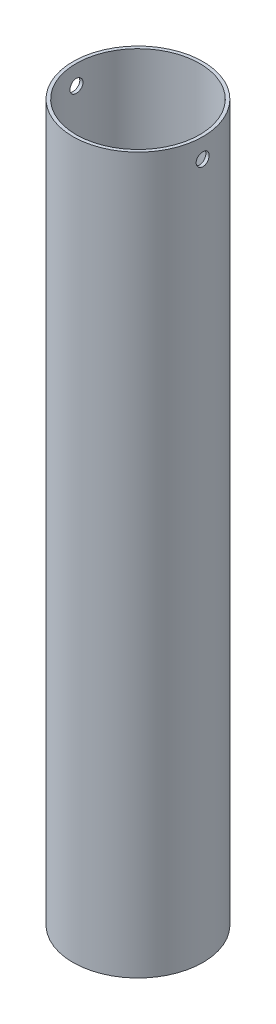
ISO-10303-21;
HEADER;
FILE_DESCRIPTION(('STEP AP214'),'2;1');
FILE_NAME('part.step','',(''),(''),'','','');
FILE_SCHEMA(('AUTOMOTIVE_DESIGN { 1 0 10303 214 1 1 1 1 }'));
ENDSEC;
DATA;
#1=APPLICATION_CONTEXT('core data for automotive mechanical design processes');
#2=APPLICATION_PROTOCOL_DEFINITION('international standard','automotive_design',2000,#1);
#3=PRODUCT_CONTEXT('',#1,'mechanical');
#4=PRODUCT('Part','Part','',(#3));
#5=PRODUCT_RELATED_PRODUCT_CATEGORY('part','',(#4));
#6=PRODUCT_DEFINITION_FORMATION('','',#4);
#7=PRODUCT_DEFINITION_CONTEXT('part definition',#1,'design');
#8=PRODUCT_DEFINITION('design','',#6,#7);
#9=PRODUCT_DEFINITION_SHAPE('','',#8);
#10=(LENGTH_UNIT() NAMED_UNIT(*) SI_UNIT(.MILLI.,.METRE.));
#11=(NAMED_UNIT(*) PLANE_ANGLE_UNIT() SI_UNIT($,.RADIAN.));
#12=(NAMED_UNIT(*) SI_UNIT($,.STERADIAN.) SOLID_ANGLE_UNIT());
#13=UNCERTAINTY_MEASURE_WITH_UNIT(LENGTH_MEASURE(1.E-05),#10,'distance_accuracy_value','');
#14=(GEOMETRIC_REPRESENTATION_CONTEXT(3) GLOBAL_UNCERTAINTY_ASSIGNED_CONTEXT((#13)) GLOBAL_UNIT_ASSIGNED_CONTEXT((#10,
#11,#12)) REPRESENTATION_CONTEXT('',''));
#15=CARTESIAN_POINT('',(0.,0.,0.));
#16=DIRECTION('',(0.,0.,1.));
#17=DIRECTION('',(1.,0.,0.));
#18=AXIS2_PLACEMENT_3D('',#15,#16,#17);
#19=CARTESIAN_POINT('',(0.,-110.,0.));
#20=DIRECTION('',(0.,1.,0.));
#21=DIRECTION('',(0.,0.,1.));
#22=AXIS2_PLACEMENT_3D('',#19,#20,#21);
#23=CYLINDRICAL_SURFACE('',#22,10.);
#24=CARTESIAN_POINT('',(-9.9498743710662,-3.,-1.));
#25=CARTESIAN_POINT('',(-9.94987502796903,-3.0560195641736,-0.999997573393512));
#26=CARTESIAN_POINT('',(-9.95035256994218,-3.11207616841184,-0.995276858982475));
#27=CARTESIAN_POINT('',(-9.95221087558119,-3.22263518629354,-0.976516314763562));
#28=CARTESIAN_POINT('',(-9.95359263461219,-3.27713581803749,-0.962466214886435));
#29=CARTESIAN_POINT('',(-9.95710133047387,-3.38296581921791,-0.925460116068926));
#30=CARTESIAN_POINT('',(-9.9592278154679,-3.43429708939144,-0.902509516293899));
#31=CARTESIAN_POINT('',(-9.9639858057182,-3.53236779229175,-0.848364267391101));
#32=CARTESIAN_POINT('',(-9.96661721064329,-3.57910813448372,-0.817171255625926));
#33=CARTESIAN_POINT('',(-9.97209926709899,-3.6668512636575,-0.747304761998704));
#34=CARTESIAN_POINT('',(-9.97495060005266,-3.70783500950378,-0.708607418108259));
#35=CARTESIAN_POINT('',(-9.98054505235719,-3.78273760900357,-0.624881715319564));
#36=CARTESIAN_POINT('',(-9.98328816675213,-3.81665613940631,-0.579853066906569));
#37=CARTESIAN_POINT('',(-9.98836383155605,-3.87653125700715,-0.484626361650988));
#38=CARTESIAN_POINT('',(-9.99069550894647,-3.90247099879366,-0.434417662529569));
#39=CARTESIAN_POINT('',(-9.9946781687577,-3.94554443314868,-0.33032998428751));
#40=CARTESIAN_POINT('',(-9.99632916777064,-3.96267834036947,-0.276451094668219));
#41=CARTESIAN_POINT('',(-9.99875966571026,-3.98759790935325,-0.16674478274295));
#42=CARTESIAN_POINT('',(-9.99954207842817,-3.99541483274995,-0.110924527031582));
#43=CARTESIAN_POINT('',(-10.0001571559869,-4.00157526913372,0.00124074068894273));
#44=CARTESIAN_POINT('',(-9.99998984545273,-3.99991902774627,0.057585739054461));
#45=CARTESIAN_POINT('',(-9.99872671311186,-3.98720552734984,0.16898884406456));
#46=CARTESIAN_POINT('',(-9.99763421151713,-3.97618188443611,0.224050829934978));
#47=CARTESIAN_POINT('',(-9.9946472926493,-3.94509887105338,0.331539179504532));
#48=CARTESIAN_POINT('',(-9.99275286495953,-3.92503938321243,0.383965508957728));
#49=CARTESIAN_POINT('',(-9.98836937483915,-3.87641723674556,0.484800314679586));
#50=CARTESIAN_POINT('',(-9.98587927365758,-3.84783970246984,0.533201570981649));
#51=CARTESIAN_POINT('',(-9.98058384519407,-3.78300347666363,0.624533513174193));
#52=CARTESIAN_POINT('',(-9.97777850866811,-3.74674455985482,0.667464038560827));
#53=CARTESIAN_POINT('',(-9.97215293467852,-3.66738577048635,0.746832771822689));
#54=CARTESIAN_POINT('',(-9.96933268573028,-3.62425665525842,0.783241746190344));
#55=CARTESIAN_POINT('',(-9.96400739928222,-3.53248313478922,0.848307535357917));
#56=CARTESIAN_POINT('',(-9.96150236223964,-3.48383872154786,0.876964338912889));
#57=CARTESIAN_POINT('',(-9.95709089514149,-3.38239297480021,0.92571218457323));
#58=CARTESIAN_POINT('',(-9.95518459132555,-3.32959076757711,0.945801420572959));
#59=CARTESIAN_POINT('',(-9.95218901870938,-3.22133939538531,0.976820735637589));
#60=CARTESIAN_POINT('',(-9.95109972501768,-3.16589031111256,0.987751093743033));
#61=CARTESIAN_POINT('',(-9.94986580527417,-3.05417582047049,1.00010477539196));
#62=CARTESIAN_POINT('',(-9.94971711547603,-2.99791497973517,1.00156899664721));
#63=CARTESIAN_POINT('',(-9.95037051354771,-2.88594873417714,0.995056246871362));
#64=CARTESIAN_POINT('',(-9.95117258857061,-2.83024332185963,0.987079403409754));
#65=CARTESIAN_POINT('',(-9.95363344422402,-2.72108841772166,0.961945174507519));
#66=CARTESIAN_POINT('',(-9.95529042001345,-2.66763442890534,0.944807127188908));
#67=CARTESIAN_POINT('',(-9.95927291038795,-2.5643599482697,0.90185671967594));
#68=CARTESIAN_POINT('',(-9.9615984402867,-2.51453953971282,0.876044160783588));
#69=CARTESIAN_POINT('',(-9.96666584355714,-2.41976002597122,0.816375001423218));
#70=CARTESIAN_POINT('',(-9.96940910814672,-2.37481805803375,0.782491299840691));
#71=CARTESIAN_POINT('',(-9.97499832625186,-2.29124494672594,0.707680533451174));
#72=CARTESIAN_POINT('',(-9.97784428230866,-2.25261395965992,0.666753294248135));
#73=CARTESIAN_POINT('',(-9.98333047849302,-2.18261836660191,0.578839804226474));
#74=CARTESIAN_POINT('',(-9.98596994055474,-2.15128044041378,0.531832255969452));
#75=CARTESIAN_POINT('',(-9.99073442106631,-2.09694413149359,0.433197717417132));
#76=CARTESIAN_POINT('',(-9.99285944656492,-2.0739456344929,0.381570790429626));
#77=CARTESIAN_POINT('',(-9.99635210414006,-2.03698623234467,0.275256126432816));
#78=CARTESIAN_POINT('',(-9.99772108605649,-2.02300921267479,0.22057403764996));
#79=CARTESIAN_POINT('',(-9.99955294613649,-2.00443693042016,0.10962481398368));
#80=CARTESIAN_POINT('',(-10.0000158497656,-1.99984140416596,0.0533577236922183));
#81=CARTESIAN_POINT('',(-9.99998338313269,-2.00016626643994,-0.0589022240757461));
#82=CARTESIAN_POINT('',(-9.99949218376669,-2.00504523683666,-0.114895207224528));
#83=CARTESIAN_POINT('',(-9.99761493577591,-2.02409374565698,-0.225261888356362));
#84=CARTESIAN_POINT('',(-9.99622888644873,-2.03826329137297,-0.279635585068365));
#85=CARTESIAN_POINT('',(-9.99271723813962,-2.07547925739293,-0.385219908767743));
#86=CARTESIAN_POINT('',(-9.99059174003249,-2.09852446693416,-0.436430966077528));
#87=CARTESIAN_POINT('',(-9.98583812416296,-2.15283316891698,-0.534264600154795));
#88=CARTESIAN_POINT('',(-9.98321000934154,-2.18409661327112,-0.580887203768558));
#89=CARTESIAN_POINT('',(-9.97773184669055,-2.25410961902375,-0.668432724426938));
#90=CARTESIAN_POINT('',(-9.97488091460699,-2.2928900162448,-0.70933092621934));
#91=CARTESIAN_POINT('',(-9.96928590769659,-2.37677535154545,-0.784057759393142));
#92=CARTESIAN_POINT('',(-9.96654185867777,-2.42188180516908,-0.817884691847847));
#93=CARTESIAN_POINT('',(-9.96146383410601,-2.51726434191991,-0.877576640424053));
#94=CARTESIAN_POINT('',(-9.95913091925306,-2.56755328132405,-0.903421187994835));
#95=CARTESIAN_POINT('',(-9.95515194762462,-2.67174829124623,-0.946264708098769));
#96=CARTESIAN_POINT('',(-9.95350511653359,-2.72565020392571,-0.963273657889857));
#97=CARTESIAN_POINT('',(-9.95150007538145,-2.81654774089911,-0.983721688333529));
#98=CARTESIAN_POINT('',(-9.95089331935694,-2.85296225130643,-0.989817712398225));
#99=CARTESIAN_POINT('',(-9.95008025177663,-2.92624582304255,-0.997957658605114));
#100=CARTESIAN_POINT('',(-9.94987393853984,-2.96311488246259,-1.00000159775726));
#101=CARTESIAN_POINT('',(-9.9498743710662,-3.,-1.));
#102=B_SPLINE_CURVE_WITH_KNOTS('',3,(#24,#25,#26,#27,#28,#29,#30,#31,#32,#33,#34,#35,#36,#37,
#38,#39,#40,#41,#42,#43,#44,#45,#46,#47,#48,#49,#50,#51,#52,#53,#54,#55,#56,#57,#58,#59,#60,#61,
#62,#63,#64,#65,#66,#67,#68,#69,#70,#71,#72,#73,#74,#75,#76,#77,#78,#79,#80,#81,#82,#83,#84,#85,
#86,#87,#88,#89,#90,#91,#92,#93,#94,#95,#96,#97,#98,#99,#100,#101),.UNSPECIFIED.,.T.,.F.,(4,2,2,
2,2,2,2,2,2,2,2,2,2,2,2,2,2,2,2,2,2,2,2,2,2,2,2,2,2,2,2,2,2,2,2,2,2,2,4),(0.,0.167923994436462,
0.336033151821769,0.504040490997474,0.672014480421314,0.840531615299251,1.00905645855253,
1.17793469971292,1.34680882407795,1.51511470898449,1.68341622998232,1.85111631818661,
2.01881858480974,2.18681545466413,2.35481725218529,2.52355425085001,2.69229149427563,
2.86106429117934,3.02983194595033,3.19786996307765,3.3659057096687,3.53358814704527,
3.70127442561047,3.86953189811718,4.03779353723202,4.20666136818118,4.37552688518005,
4.54408992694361,4.71264823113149,4.88047133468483,5.04829456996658,5.21609491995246,
5.38389428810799,5.55239715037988,5.72094045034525,5.88991241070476,6.05869314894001,
6.16926027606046,6.27982693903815),.UNSPECIFIED.);
#103=CARTESIAN_POINT('',(-9.9498743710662,-3.,-1.));
#104=VERTEX_POINT('',#103);
#105=EDGE_CURVE('E72',#104,#104,#102,.T.);
#106=ORIENTED_EDGE('',*,*,#105,.F.);
#107=EDGE_LOOP('',(#106));
#108=FACE_BOUND('',#107,.T.);
#109=CARTESIAN_POINT('',(9.9498743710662,-3.,-1.));
#110=CARTESIAN_POINT('',(9.94987502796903,-2.9439804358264,-0.999997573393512));
#111=CARTESIAN_POINT('',(9.95035256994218,-2.88792383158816,-0.995276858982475));
#112=CARTESIAN_POINT('',(9.95221087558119,-2.77736481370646,-0.976516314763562));
#113=CARTESIAN_POINT('',(9.95359263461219,-2.72286418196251,-0.962466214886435));
#114=CARTESIAN_POINT('',(9.95710133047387,-2.61703418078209,-0.925460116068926));
#115=CARTESIAN_POINT('',(9.9592278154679,-2.56570291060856,-0.902509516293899));
#116=CARTESIAN_POINT('',(9.9639858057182,-2.46763220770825,-0.848364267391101));
#117=CARTESIAN_POINT('',(9.96661721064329,-2.42089186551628,-0.817171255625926));
#118=CARTESIAN_POINT('',(9.97209926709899,-2.3331487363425,-0.747304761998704));
#119=CARTESIAN_POINT('',(9.97495060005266,-2.29216499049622,-0.708607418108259));
#120=CARTESIAN_POINT('',(9.98054505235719,-2.21726239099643,-0.624881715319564));
#121=CARTESIAN_POINT('',(9.98328816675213,-2.18334386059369,-0.579853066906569));
#122=CARTESIAN_POINT('',(9.98836383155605,-2.12346874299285,-0.484626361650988));
#123=CARTESIAN_POINT('',(9.99069550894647,-2.09752900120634,-0.434417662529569));
#124=CARTESIAN_POINT('',(9.9946781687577,-2.05445556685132,-0.330329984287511));
#125=CARTESIAN_POINT('',(9.99632916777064,-2.03732165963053,-0.276451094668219));
#126=CARTESIAN_POINT('',(9.99875966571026,-2.01240209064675,-0.16674478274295));
#127=CARTESIAN_POINT('',(9.99954207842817,-2.00458516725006,-0.110924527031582));
#128=CARTESIAN_POINT('',(10.0001571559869,-1.99842473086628,0.00124074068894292));
#129=CARTESIAN_POINT('',(9.99998984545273,-2.00008097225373,0.0575857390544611));
#130=CARTESIAN_POINT('',(9.99872671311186,-2.01279447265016,0.16898884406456));
#131=CARTESIAN_POINT('',(9.99763421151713,-2.02381811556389,0.224050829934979));
#132=CARTESIAN_POINT('',(9.9946472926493,-2.05490112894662,0.331539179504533));
#133=CARTESIAN_POINT('',(9.99275286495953,-2.07496061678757,0.383965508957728));
#134=CARTESIAN_POINT('',(9.98836937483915,-2.12358276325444,0.484800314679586));
#135=CARTESIAN_POINT('',(9.98587927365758,-2.15216029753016,0.533201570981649));
#136=CARTESIAN_POINT('',(9.98058384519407,-2.21699652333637,0.624533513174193));
#137=CARTESIAN_POINT('',(9.97777850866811,-2.25325544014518,0.667464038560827));
#138=CARTESIAN_POINT('',(9.97215293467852,-2.33261422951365,0.746832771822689));
#139=CARTESIAN_POINT('',(9.96933268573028,-2.37574334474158,0.783241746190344));
#140=CARTESIAN_POINT('',(9.96400739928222,-2.46751686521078,0.848307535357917));
#141=CARTESIAN_POINT('',(9.96150236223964,-2.51616127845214,0.876964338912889));
#142=CARTESIAN_POINT('',(9.95709089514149,-2.61760702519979,0.92571218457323));
#143=CARTESIAN_POINT('',(9.95518459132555,-2.67040923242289,0.94580142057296));
#144=CARTESIAN_POINT('',(9.95218901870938,-2.77866060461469,0.976820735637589));
#145=CARTESIAN_POINT('',(9.95109972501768,-2.83410968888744,0.987751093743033));
#146=CARTESIAN_POINT('',(9.94986580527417,-2.94582417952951,1.00010477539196));
#147=CARTESIAN_POINT('',(9.94971711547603,-3.00208502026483,1.00156899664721));
#148=CARTESIAN_POINT('',(9.95037051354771,-3.11405126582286,0.995056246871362));
#149=CARTESIAN_POINT('',(9.95117258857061,-3.16975667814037,0.987079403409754));
#150=CARTESIAN_POINT('',(9.95363344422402,-3.27891158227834,0.961945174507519));
#151=CARTESIAN_POINT('',(9.95529042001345,-3.33236557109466,0.944807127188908));
#152=CARTESIAN_POINT('',(9.95927291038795,-3.4356400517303,0.90185671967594));
#153=CARTESIAN_POINT('',(9.9615984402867,-3.48546046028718,0.876044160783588));
#154=CARTESIAN_POINT('',(9.96666584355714,-3.58023997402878,0.816375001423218));
#155=CARTESIAN_POINT('',(9.96940910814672,-3.62518194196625,0.782491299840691));
#156=CARTESIAN_POINT('',(9.97499832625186,-3.70875505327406,0.707680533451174));
#157=CARTESIAN_POINT('',(9.97784428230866,-3.74738604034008,0.666753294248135));
#158=CARTESIAN_POINT('',(9.98333047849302,-3.81738163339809,0.578839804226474));
#159=CARTESIAN_POINT('',(9.98596994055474,-3.84871955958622,0.531832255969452));
#160=CARTESIAN_POINT('',(9.99073442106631,-3.90305586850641,0.433197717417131));
#161=CARTESIAN_POINT('',(9.99285944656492,-3.9260543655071,0.381570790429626));
#162=CARTESIAN_POINT('',(9.99635210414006,-3.96301376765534,0.275256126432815));
#163=CARTESIAN_POINT('',(9.99772108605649,-3.97699078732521,0.22057403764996));
#164=CARTESIAN_POINT('',(9.99955294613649,-3.99556306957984,0.10962481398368));
#165=CARTESIAN_POINT('',(10.0000158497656,-4.00015859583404,0.053357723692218));
#166=CARTESIAN_POINT('',(9.99998338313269,-3.99983373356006,-0.0589022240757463));
#167=CARTESIAN_POINT('',(9.99949218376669,-3.99495476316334,-0.114895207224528));
#168=CARTESIAN_POINT('',(9.99761493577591,-3.97590625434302,-0.225261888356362));
#169=CARTESIAN_POINT('',(9.99622888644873,-3.96173670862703,-0.279635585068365));
#170=CARTESIAN_POINT('',(9.99271723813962,-3.92452074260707,-0.385219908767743));
#171=CARTESIAN_POINT('',(9.99059174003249,-3.90147553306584,-0.436430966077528));
#172=CARTESIAN_POINT('',(9.98583812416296,-3.84716683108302,-0.534264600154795));
#173=CARTESIAN_POINT('',(9.98321000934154,-3.81590338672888,-0.580887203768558));
#174=CARTESIAN_POINT('',(9.97773184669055,-3.74589038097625,-0.668432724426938));
#175=CARTESIAN_POINT('',(9.97488091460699,-3.7071099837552,-0.70933092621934));
#176=CARTESIAN_POINT('',(9.96928590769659,-3.62322464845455,-0.784057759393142));
#177=CARTESIAN_POINT('',(9.96654185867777,-3.57811819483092,-0.817884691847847));
#178=CARTESIAN_POINT('',(9.96146383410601,-3.48273565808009,-0.877576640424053));
#179=CARTESIAN_POINT('',(9.95913091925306,-3.43244671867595,-0.903421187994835));
#180=CARTESIAN_POINT('',(9.95515194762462,-3.32825170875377,-0.946264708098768));
#181=CARTESIAN_POINT('',(9.95350511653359,-3.27434979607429,-0.963273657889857));
#182=CARTESIAN_POINT('',(9.95150007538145,-3.18345225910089,-0.983721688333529));
#183=CARTESIAN_POINT('',(9.95089331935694,-3.14703774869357,-0.989817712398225));
#184=CARTESIAN_POINT('',(9.95008025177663,-3.07375417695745,-0.997957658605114));
#185=CARTESIAN_POINT('',(9.94987393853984,-3.03688511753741,-1.00000159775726));
#186=CARTESIAN_POINT('',(9.9498743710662,-3.,-1.));
#187=B_SPLINE_CURVE_WITH_KNOTS('',3,(#109,#110,#111,#112,#113,#114,#115,#116,#117,#118,#119,
#120,#121,#122,#123,#124,#125,#126,#127,#128,#129,#130,#131,#132,#133,#134,#135,#136,#137,#138,
#139,#140,#141,#142,#143,#144,#145,#146,#147,#148,#149,#150,#151,#152,#153,#154,#155,#156,#157,
#158,#159,#160,#161,#162,#163,#164,#165,#166,#167,#168,#169,#170,#171,#172,#173,#174,#175,#176,
#177,#178,#179,#180,#181,#182,#183,#184,#185,#186),.UNSPECIFIED.,.T.,.F.,(4,2,2,2,2,2,2,2,2,2,2,
2,2,2,2,2,2,2,2,2,2,2,2,2,2,2,2,2,2,2,2,2,2,2,2,2,2,2,4),(0.,0.167923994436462,
0.336033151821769,0.504040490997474,0.672014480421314,0.84053161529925,1.00905645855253,
1.17793469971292,1.34680882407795,1.51511470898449,1.68341622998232,1.85111631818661,
2.01881858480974,2.18681545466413,2.35481725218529,2.52355425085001,2.69229149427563,
2.86106429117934,3.02983194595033,3.19786996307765,3.3659057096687,3.53358814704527,
3.70127442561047,3.86953189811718,4.03779353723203,4.20666136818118,4.37552688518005,
4.54408992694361,4.71264823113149,4.88047133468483,5.04829456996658,5.21609491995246,
5.38389428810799,5.55239715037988,5.72094045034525,5.88991241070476,6.05869314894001,
6.16926027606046,6.27982693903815),.UNSPECIFIED.);
#188=CARTESIAN_POINT('',(9.9498743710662,-3.,-1.));
#189=VERTEX_POINT('',#188);
#190=EDGE_CURVE('E68',#189,#189,#187,.T.);
#191=ORIENTED_EDGE('',*,*,#190,.F.);
#192=EDGE_LOOP('',(#191));
#193=FACE_BOUND('',#192,.T.);
#194=CARTESIAN_POINT('',(0.,-110.,0.));
#195=DIRECTION('',(0.,1.,0.));
#196=DIRECTION('',(0.,0.,1.));
#197=AXIS2_PLACEMENT_3D('',#194,#195,#196);
#198=CIRCLE('',#197,10.);
#199=CARTESIAN_POINT('',(0.,-110.,10.));
#200=VERTEX_POINT('',#199);
#201=EDGE_CURVE('E10',#200,#200,#198,.T.);
#202=ORIENTED_EDGE('',*,*,#201,.T.);
#203=EDGE_LOOP('',(#202));
#204=FACE_BOUND('',#203,.T.);
#205=CARTESIAN_POINT('',(0.,0.,0.));
#206=DIRECTION('',(0.,1.,0.));
#207=DIRECTION('',(0.,0.,1.));
#208=AXIS2_PLACEMENT_3D('',#205,#206,#207);
#209=CIRCLE('',#208,10.);
#210=CARTESIAN_POINT('',(0.,0.,10.));
#211=VERTEX_POINT('',#210);
#212=EDGE_CURVE('E41',#211,#211,#209,.T.);
#213=ORIENTED_EDGE('',*,*,#212,.F.);
#214=EDGE_LOOP('',(#213));
#215=FACE_BOUND('',#214,.T.);
#216=ADVANCED_FACE('F29',(#108,#193,#204,#215),#23,.T.);
#217=CARTESIAN_POINT('',(0.,-110.,0.));
#218=DIRECTION('',(0.,1.,0.));
#219=DIRECTION('',(0.,0.,1.));
#220=AXIS2_PLACEMENT_3D('',#217,#218,#219);
#221=PLANE('',#220);
#222=CARTESIAN_POINT('',(0.,-110.,0.));
#223=DIRECTION('',(0.,1.,0.));
#224=DIRECTION('',(0.,0.,1.));
#225=AXIS2_PLACEMENT_3D('',#222,#223,#224);
#226=CIRCLE('',#225,9.5);
#227=CARTESIAN_POINT('',(0.,-110.,9.5));
#228=VERTEX_POINT('',#227);
#229=EDGE_CURVE('E46',#228,#228,#226,.T.);
#230=ORIENTED_EDGE('',*,*,#229,.T.);
#231=EDGE_LOOP('',(#230));
#232=FACE_BOUND('',#231,.T.);
#233=ORIENTED_EDGE('',*,*,#201,.F.);
#234=EDGE_LOOP('',(#233));
#235=FACE_BOUND('',#234,.T.);
#236=ADVANCED_FACE('F86',(#232,#235),#221,.F.);
#237=CARTESIAN_POINT('',(0.,0.,0.));
#238=DIRECTION('',(0.,1.,0.));
#239=DIRECTION('',(0.,0.,1.));
#240=AXIS2_PLACEMENT_3D('',#237,#238,#239);
#241=PLANE('',#240);
#242=CARTESIAN_POINT('',(0.,0.,0.));
#243=DIRECTION('',(0.,1.,0.));
#244=DIRECTION('',(0.,0.,1.));
#245=AXIS2_PLACEMENT_3D('',#242,#243,#244);
#246=CIRCLE('',#245,9.5);
#247=CARTESIAN_POINT('',(0.,0.,9.5));
#248=VERTEX_POINT('',#247);
#249=EDGE_CURVE('E49',#248,#248,#246,.T.);
#250=ORIENTED_EDGE('',*,*,#249,.F.);
#251=EDGE_LOOP('',(#250));
#252=FACE_BOUND('',#251,.T.);
#253=ORIENTED_EDGE('',*,*,#212,.T.);
#254=EDGE_LOOP('',(#253));
#255=FACE_BOUND('',#254,.T.);
#256=ADVANCED_FACE('F83',(#252,#255),#241,.T.);
#257=CARTESIAN_POINT('',(0.,-110.,0.));
#258=DIRECTION('',(0.,1.,0.));
#259=DIRECTION('',(0.,0.,1.));
#260=AXIS2_PLACEMENT_3D('',#257,#258,#259);
#261=CYLINDRICAL_SURFACE('',#260,9.5);
#262=CARTESIAN_POINT('',(-9.44722181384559,-3.,-1.));
#263=CARTESIAN_POINT('',(-9.44722250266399,-3.05600323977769,-0.99999758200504));
#264=CARTESIAN_POINT('',(-9.44772516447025,-3.1120431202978,-0.995279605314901));
#265=CARTESIAN_POINT('',(-9.44968112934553,-3.22256802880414,-0.97653057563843));
#266=CARTESIAN_POINT('',(-9.45113546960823,-3.27705129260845,-0.962489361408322));
#267=CARTESIAN_POINT('',(-9.45482827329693,-3.38284646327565,-0.925508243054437));
#268=CARTESIAN_POINT('',(-9.45706625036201,-3.43416031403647,-0.902573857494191));
#269=CARTESIAN_POINT('',(-9.46207356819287,-3.53219959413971,-0.848468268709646));
#270=CARTESIAN_POINT('',(-9.46484280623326,-3.57892590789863,-0.817298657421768));
#271=CARTESIAN_POINT('',(-9.47061306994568,-3.66666202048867,-0.74747313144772));
#272=CARTESIAN_POINT('',(-9.47361488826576,-3.70765080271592,-0.708790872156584));
#273=CARTESIAN_POINT('',(-9.47950490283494,-3.78256723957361,-0.62509450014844));
#274=CARTESIAN_POINT('',(-9.4823930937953,-3.81649456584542,-0.580080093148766));
#275=CARTESIAN_POINT('',(-9.48773832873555,-3.87639828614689,-0.484867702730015));
#276=CARTESIAN_POINT('',(-9.49019435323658,-3.90235598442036,-0.434657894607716));
#277=CARTESIAN_POINT('',(-9.49438988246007,-3.94546397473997,-0.330561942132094));
#278=CARTESIAN_POINT('',(-9.49612940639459,-3.96261450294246,-0.276675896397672));
#279=CARTESIAN_POINT('',(-9.49869036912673,-3.98755941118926,-0.166970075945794));
#280=CARTESIAN_POINT('',(-9.4995152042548,-3.99538841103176,-0.111158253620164));
#281=CARTESIAN_POINT('',(-9.50016541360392,-4.00157517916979,0.0009928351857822));
#282=CARTESIAN_POINT('',(-9.49999081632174,-3.99993321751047,0.057332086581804));
#283=CARTESIAN_POINT('',(-9.49866460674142,-3.98725270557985,0.168703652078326));
#284=CARTESIAN_POINT('',(-9.4975168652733,-3.97625138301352,0.223740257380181));
#285=CARTESIAN_POINT('',(-9.49437776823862,-3.94522247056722,0.331181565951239));
#286=CARTESIAN_POINT('',(-9.49238640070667,-3.92519475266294,0.383586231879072));
#287=CARTESIAN_POINT('',(-9.48777724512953,-3.87664098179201,0.484393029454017));
#288=CARTESIAN_POINT('',(-9.4851582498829,-3.84809852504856,0.532787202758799));
#289=CARTESIAN_POINT('',(-9.47958754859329,-3.78333740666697,0.624112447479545));
#290=CARTESIAN_POINT('',(-9.47663583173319,-3.74711849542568,0.667043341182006));
#291=CARTESIAN_POINT('',(-9.47071386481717,-3.66782338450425,0.746441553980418));
#292=CARTESIAN_POINT('',(-9.46774359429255,-3.62471478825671,0.782876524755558));
#293=CARTESIAN_POINT('',(-9.46213353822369,-3.532976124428,0.847998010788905));
#294=CARTESIAN_POINT('',(-9.45949375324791,-3.48434604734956,0.876684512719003));
#295=CARTESIAN_POINT('',(-9.45484337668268,-3.38291923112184,0.925494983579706));
#296=CARTESIAN_POINT('',(-9.45283294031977,-3.33012146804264,0.945616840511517));
#297=CARTESIAN_POINT('',(-9.44967206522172,-3.22187081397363,0.976700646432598));
#298=CARTESIAN_POINT('',(-9.44852159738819,-3.16641801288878,0.987662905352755));
#299=CARTESIAN_POINT('',(-9.44721601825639,-3.05471569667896,1.00007449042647));
#300=CARTESIAN_POINT('',(-9.44705616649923,-2.9984712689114,1.00156912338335));
#301=CARTESIAN_POINT('',(-9.44773740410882,-2.88653277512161,0.995122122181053));
#302=CARTESIAN_POINT('',(-9.44857847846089,-2.83083870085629,0.987180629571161));
#303=CARTESIAN_POINT('',(-9.45116248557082,-2.72171463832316,0.962124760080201));
#304=CARTESIAN_POINT('',(-9.45290330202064,-2.66827965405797,0.945031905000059));
#305=CARTESIAN_POINT('',(-9.457088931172,-2.56503510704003,0.902180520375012));
#306=CARTESIAN_POINT('',(-9.45953376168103,-2.51522563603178,0.876421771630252));
#307=CARTESIAN_POINT('',(-9.46486340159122,-2.42043980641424,0.816856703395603));
#308=CARTESIAN_POINT('',(-9.46774983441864,-2.3754823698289,0.78302042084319));
#309=CARTESIAN_POINT('',(-9.47363218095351,-2.29186889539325,0.708303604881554));
#310=CARTESIAN_POINT('',(-9.47662809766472,-2.25321303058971,0.667422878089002));
#311=CARTESIAN_POINT('',(-9.48240620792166,-2.18314319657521,0.579580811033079));
#312=CARTESIAN_POINT('',(-9.48518749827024,-2.15175882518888,0.532595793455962));
#313=CARTESIAN_POINT('',(-9.49020976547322,-2.09732675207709,0.433995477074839));
#314=CARTESIAN_POINT('',(-9.49245075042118,-2.07427892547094,0.382380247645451));
#315=CARTESIAN_POINT('',(-9.49613584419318,-2.03722409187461,0.27608703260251));
#316=CARTESIAN_POINT('',(-9.49758151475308,-2.02319935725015,0.221415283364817));
#317=CARTESIAN_POINT('',(-9.49951951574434,-2.00453099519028,0.110476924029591));
#318=CARTESIAN_POINT('',(-9.50001187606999,-1.99988707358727,0.0542103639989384));
#319=CARTESIAN_POINT('',(-9.49998774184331,-2.0001165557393,-0.0580300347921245));
#320=CARTESIAN_POINT('',(-9.49947611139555,-2.00494407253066,-0.114003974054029));
#321=CARTESIAN_POINT('',(-9.49751109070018,-2.02388298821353,-0.224340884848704));
#322=CARTESIAN_POINT('',(-9.49605769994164,-2.03799439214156,-0.278703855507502));
#323=CARTESIAN_POINT('',(-9.49237193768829,-2.07508745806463,-0.38427419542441));
#324=CARTESIAN_POINT('',(-9.490139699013,-2.09806760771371,-0.43548210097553));
#325=CARTESIAN_POINT('',(-9.48514475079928,-2.15224100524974,-0.533321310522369));
#326=CARTESIAN_POINT('',(-9.48238204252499,-2.18343423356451,-0.579952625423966));
#327=CARTESIAN_POINT('',(-9.4766194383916,-2.25332005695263,-0.667550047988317));
#328=CARTESIAN_POINT('',(-9.47361849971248,-2.29204683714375,-0.708488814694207));
#329=CARTESIAN_POINT('',(-9.46772640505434,-2.37583199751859,-0.783306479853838));
#330=CARTESIAN_POINT('',(-9.46483527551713,-2.42089189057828,-0.817183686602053));
#331=CARTESIAN_POINT('',(-9.45948152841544,-2.51620336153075,-0.876992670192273));
#332=CARTESIAN_POINT('',(-9.4570201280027,-2.56646906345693,-0.902902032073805));
#333=CARTESIAN_POINT('',(-9.45281896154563,-2.6706322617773,-0.945877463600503));
#334=CARTESIAN_POINT('',(-9.45107838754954,-2.7245256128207,-0.962953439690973));
#335=CARTESIAN_POINT('',(-9.44895178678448,-2.81559943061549,-0.98355157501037));
#336=CARTESIAN_POINT('',(-9.44830614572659,-2.85219901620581,-0.989711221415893));
#337=CARTESIAN_POINT('',(-9.44744093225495,-2.92586038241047,-0.997936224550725));
#338=CARTESIAN_POINT('',(-9.44722135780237,-2.96292216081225,-1.00000160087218));
#339=CARTESIAN_POINT('',(-9.44722181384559,-3.,-1.));
#340=B_SPLINE_CURVE_WITH_KNOTS('',3,(#262,#263,#264,#265,#266,#267,#268,#269,#270,#271,#272,
#273,#274,#275,#276,#277,#278,#279,#280,#281,#282,#283,#284,#285,#286,#287,#288,#289,#290,#291,
#292,#293,#294,#295,#296,#297,#298,#299,#300,#301,#302,#303,#304,#305,#306,#307,#308,#309,#310,
#311,#312,#313,#314,#315,#316,#317,#318,#319,#320,#321,#322,#323,#324,#325,#326,#327,#328,#329,
#330,#331,#332,#333,#334,#335,#336,#337,#338,#339),.UNSPECIFIED.,.T.,.F.,(4,2,2,2,2,2,2,2,2,2,2,
2,2,2,2,2,2,2,2,2,2,2,2,2,2,2,2,2,2,2,2,2,2,2,2,2,2,2,4),(0.,0.167874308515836,
0.335931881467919,0.503885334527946,0.671806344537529,0.840327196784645,1.00885588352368,
1.17777694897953,1.34669348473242,1.51498069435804,1.68326310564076,1.8508792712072,
2.01849781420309,2.18644138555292,2.35439041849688,2.52315376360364,2.69191739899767,
2.86072262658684,3.02952214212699,3.19751326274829,3.36550186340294,3.53309711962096,
3.70069661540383,3.86892774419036,4.03716349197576,4.20607244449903,4.37497886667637,
4.54355241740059,4.71212068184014,4.87987428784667,5.04762798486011,5.21535308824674,
5.38307779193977,5.55158212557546,5.7201267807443,5.8891413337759,6.05796592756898,
6.16911032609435,6.28025419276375),.UNSPECIFIED.);
#341=CARTESIAN_POINT('',(-9.44722181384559,-3.,-1.));
#342=VERTEX_POINT('',#341);
#343=EDGE_CURVE('E33',#342,#342,#340,.T.);
#344=ORIENTED_EDGE('',*,*,#343,.T.);
#345=EDGE_LOOP('',(#344));
#346=FACE_BOUND('',#345,.T.);
#347=CARTESIAN_POINT('',(9.44722181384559,-3.,-1.));
#348=CARTESIAN_POINT('',(9.44722250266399,-2.94399676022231,-0.99999758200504));
#349=CARTESIAN_POINT('',(9.44772516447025,-2.8879568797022,-0.995279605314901));
#350=CARTESIAN_POINT('',(9.44968112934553,-2.77743197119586,-0.97653057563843));
#351=CARTESIAN_POINT('',(9.45113546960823,-2.72294870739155,-0.962489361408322));
#352=CARTESIAN_POINT('',(9.45482827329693,-2.61715353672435,-0.925508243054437));
#353=CARTESIAN_POINT('',(9.45706625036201,-2.56583968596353,-0.902573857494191));
#354=CARTESIAN_POINT('',(9.46207356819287,-2.46780040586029,-0.848468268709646));
#355=CARTESIAN_POINT('',(9.46484280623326,-2.42107409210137,-0.817298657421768));
#356=CARTESIAN_POINT('',(9.47061306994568,-2.33333797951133,-0.74747313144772));
#357=CARTESIAN_POINT('',(9.47361488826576,-2.29234919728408,-0.708790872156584));
#358=CARTESIAN_POINT('',(9.47950490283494,-2.21743276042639,-0.62509450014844));
#359=CARTESIAN_POINT('',(9.4823930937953,-2.18350543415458,-0.580080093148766));
#360=CARTESIAN_POINT('',(9.48773832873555,-2.12360171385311,-0.484867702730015));
#361=CARTESIAN_POINT('',(9.49019435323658,-2.09764401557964,-0.434657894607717));
#362=CARTESIAN_POINT('',(9.49438988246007,-2.05453602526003,-0.330561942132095));
#363=CARTESIAN_POINT('',(9.49612940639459,-2.03738549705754,-0.276675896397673));
#364=CARTESIAN_POINT('',(9.49869036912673,-2.01244058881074,-0.166970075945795));
#365=CARTESIAN_POINT('',(9.4995152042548,-2.00461158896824,-0.111158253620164));
#366=CARTESIAN_POINT('',(9.50016541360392,-1.99842482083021,0.000992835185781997));
#367=CARTESIAN_POINT('',(9.49999081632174,-2.00006678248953,0.0573320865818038));
#368=CARTESIAN_POINT('',(9.49866460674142,-2.01274729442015,0.168703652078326));
#369=CARTESIAN_POINT('',(9.4975168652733,-2.02374861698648,0.223740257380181));
#370=CARTESIAN_POINT('',(9.49437776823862,-2.05477752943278,0.33118156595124));
#371=CARTESIAN_POINT('',(9.49238640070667,-2.07480524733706,0.383586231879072));
#372=CARTESIAN_POINT('',(9.48777724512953,-2.12335901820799,0.484393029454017));
#373=CARTESIAN_POINT('',(9.4851582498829,-2.15190147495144,0.532787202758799));
#374=CARTESIAN_POINT('',(9.47958754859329,-2.21666259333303,0.624112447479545));
#375=CARTESIAN_POINT('',(9.47663583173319,-2.25288150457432,0.667043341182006));
#376=CARTESIAN_POINT('',(9.47071386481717,-2.33217661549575,0.746441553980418));
#377=CARTESIAN_POINT('',(9.46774359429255,-2.37528521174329,0.782876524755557));
#378=CARTESIAN_POINT('',(9.46213353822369,-2.467023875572,0.847998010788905));
#379=CARTESIAN_POINT('',(9.45949375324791,-2.51565395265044,0.876684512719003));
#380=CARTESIAN_POINT('',(9.45484337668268,-2.61708076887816,0.925494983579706));
#381=CARTESIAN_POINT('',(9.45283294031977,-2.66987853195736,0.945616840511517));
#382=CARTESIAN_POINT('',(9.44967206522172,-2.77812918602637,0.976700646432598));
#383=CARTESIAN_POINT('',(9.44852159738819,-2.83358198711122,0.987662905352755));
#384=CARTESIAN_POINT('',(9.44721601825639,-2.94528430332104,1.00007449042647));
#385=CARTESIAN_POINT('',(9.44705616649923,-3.0015287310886,1.00156912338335));
#386=CARTESIAN_POINT('',(9.44773740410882,-3.11346722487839,0.995122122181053));
#387=CARTESIAN_POINT('',(9.44857847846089,-3.16916129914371,0.987180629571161));
#388=CARTESIAN_POINT('',(9.45116248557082,-3.27828536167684,0.962124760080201));
#389=CARTESIAN_POINT('',(9.45290330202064,-3.33172034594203,0.945031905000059));
#390=CARTESIAN_POINT('',(9.457088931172,-3.43496489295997,0.902180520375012));
#391=CARTESIAN_POINT('',(9.45953376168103,-3.48477436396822,0.876421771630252));
#392=CARTESIAN_POINT('',(9.46486340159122,-3.57956019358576,0.816856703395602));
#393=CARTESIAN_POINT('',(9.46774983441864,-3.6245176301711,0.78302042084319));
#394=CARTESIAN_POINT('',(9.47363218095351,-3.70813110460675,0.708303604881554));
#395=CARTESIAN_POINT('',(9.47662809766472,-3.74678696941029,0.667422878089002));
#396=CARTESIAN_POINT('',(9.48240620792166,-3.81685680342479,0.579580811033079));
#397=CARTESIAN_POINT('',(9.48518749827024,-3.84824117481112,0.532595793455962));
#398=CARTESIAN_POINT('',(9.49020976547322,-3.90267324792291,0.433995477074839));
#399=CARTESIAN_POINT('',(9.49245075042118,-3.92572107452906,0.382380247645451));
#400=CARTESIAN_POINT('',(9.49613584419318,-3.96277590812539,0.27608703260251));
#401=CARTESIAN_POINT('',(9.49758151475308,-3.97680064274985,0.221415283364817));
#402=CARTESIAN_POINT('',(9.49951951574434,-3.99546900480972,0.110476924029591));
#403=CARTESIAN_POINT('',(9.50001187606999,-4.00011292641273,0.0542103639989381));
#404=CARTESIAN_POINT('',(9.49998774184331,-3.9998834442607,-0.0580300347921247));
#405=CARTESIAN_POINT('',(9.49947611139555,-3.99505592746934,-0.114003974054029));
#406=CARTESIAN_POINT('',(9.49751109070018,-3.97611701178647,-0.224340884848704));
#407=CARTESIAN_POINT('',(9.49605769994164,-3.96200560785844,-0.278703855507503));
#408=CARTESIAN_POINT('',(9.49237193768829,-3.92491254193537,-0.38427419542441));
#409=CARTESIAN_POINT('',(9.490139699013,-3.90193239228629,-0.43548210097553));
#410=CARTESIAN_POINT('',(9.48514475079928,-3.84775899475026,-0.533321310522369));
#411=CARTESIAN_POINT('',(9.48238204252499,-3.81656576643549,-0.579952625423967));
#412=CARTESIAN_POINT('',(9.4766194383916,-3.74667994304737,-0.667550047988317));
#413=CARTESIAN_POINT('',(9.47361849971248,-3.70795316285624,-0.708488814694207));
#414=CARTESIAN_POINT('',(9.46772640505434,-3.62416800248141,-0.783306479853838));
#415=CARTESIAN_POINT('',(9.46483527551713,-3.57910810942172,-0.817183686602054));
#416=CARTESIAN_POINT('',(9.45948152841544,-3.48379663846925,-0.876992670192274));
#417=CARTESIAN_POINT('',(9.4570201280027,-3.43353093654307,-0.902902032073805));
#418=CARTESIAN_POINT('',(9.45281896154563,-3.3293677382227,-0.945877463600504));
#419=CARTESIAN_POINT('',(9.45107838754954,-3.2754743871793,-0.962953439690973));
#420=CARTESIAN_POINT('',(9.44895178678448,-3.18440056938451,-0.98355157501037));
#421=CARTESIAN_POINT('',(9.44830614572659,-3.14780098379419,-0.989711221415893));
#422=CARTESIAN_POINT('',(9.44744093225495,-3.07413961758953,-0.997936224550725));
#423=CARTESIAN_POINT('',(9.44722135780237,-3.03707783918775,-1.00000160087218));
#424=CARTESIAN_POINT('',(9.44722181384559,-3.,-1.));
#425=B_SPLINE_CURVE_WITH_KNOTS('',3,(#347,#348,#349,#350,#351,#352,#353,#354,#355,#356,#357,
#358,#359,#360,#361,#362,#363,#364,#365,#366,#367,#368,#369,#370,#371,#372,#373,#374,#375,#376,
#377,#378,#379,#380,#381,#382,#383,#384,#385,#386,#387,#388,#389,#390,#391,#392,#393,#394,#395,
#396,#397,#398,#399,#400,#401,#402,#403,#404,#405,#406,#407,#408,#409,#410,#411,#412,#413,#414,
#415,#416,#417,#418,#419,#420,#421,#422,#423,#424),.UNSPECIFIED.,.T.,.F.,(4,2,2,2,2,2,2,2,2,2,2,
2,2,2,2,2,2,2,2,2,2,2,2,2,2,2,2,2,2,2,2,2,2,2,2,2,2,2,4),(0.,0.167874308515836,
0.335931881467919,0.503885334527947,0.671806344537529,0.840327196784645,1.00885588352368,
1.17777694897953,1.34669348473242,1.51498069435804,1.68326310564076,1.8508792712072,
2.01849781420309,2.18644138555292,2.35439041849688,2.52315376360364,2.69191739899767,
2.86072262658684,3.02952214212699,3.19751326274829,3.36550186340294,3.53309711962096,
3.70069661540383,3.86892774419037,4.03716349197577,4.20607244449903,4.37497886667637,
4.54355241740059,4.71212068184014,4.87987428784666,5.04762798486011,5.21535308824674,
5.38307779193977,5.55158212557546,5.7201267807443,5.8891413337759,6.05796592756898,
6.16911032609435,6.28025419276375),.UNSPECIFIED.);
#426=CARTESIAN_POINT('',(9.44722181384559,-3.,-1.));
#427=VERTEX_POINT('',#426);
#428=EDGE_CURVE('E51',#427,#427,#425,.T.);
#429=ORIENTED_EDGE('',*,*,#428,.T.);
#430=EDGE_LOOP('',(#429));
#431=FACE_BOUND('',#430,.T.);
#432=ORIENTED_EDGE('',*,*,#229,.F.);
#433=EDGE_LOOP('',(#432));
#434=FACE_BOUND('',#433,.T.);
#435=ORIENTED_EDGE('',*,*,#249,.T.);
#436=EDGE_LOOP('',(#435));
#437=FACE_BOUND('',#436,.T.);
#438=ADVANCED_FACE('F55',(#346,#431,#434,#437),#261,.F.);
#439=CARTESIAN_POINT('',(-15.,-3.,0.));
#440=DIRECTION('',(1.,0.,0.));
#441=DIRECTION('',(0.,0.,-1.));
#442=AXIS2_PLACEMENT_3D('',#439,#440,#441);
#443=CYLINDRICAL_SURFACE('',#442,1.);
#444=ORIENTED_EDGE('',*,*,#190,.T.);
#445=EDGE_LOOP('',(#444));
#446=FACE_BOUND('',#445,.T.);
#447=ORIENTED_EDGE('',*,*,#428,.F.);
#448=EDGE_LOOP('',(#447));
#449=FACE_BOUND('',#448,.T.);
#450=ADVANCED_FACE('F61',(#446,#449),#443,.F.);
#451=ORIENTED_EDGE('',*,*,#105,.T.);
#452=EDGE_LOOP('',(#451));
#453=FACE_BOUND('',#452,.T.);
#454=ORIENTED_EDGE('',*,*,#343,.F.);
#455=EDGE_LOOP('',(#454));
#456=FACE_BOUND('',#455,.T.);
#457=ADVANCED_FACE('F58',(#453,#456),#443,.F.);
#458=CLOSED_SHELL('',(#216,#236,#256,#438,#450,#457));
#459=MANIFOLD_SOLID_BREP('B2',#458);
#460=ADVANCED_BREP_SHAPE_REPRESENTATION('',(#18,#459),#14);
#461=SHAPE_DEFINITION_REPRESENTATION(#9,#460);
ENDSEC;
END-ISO-10303-21;
